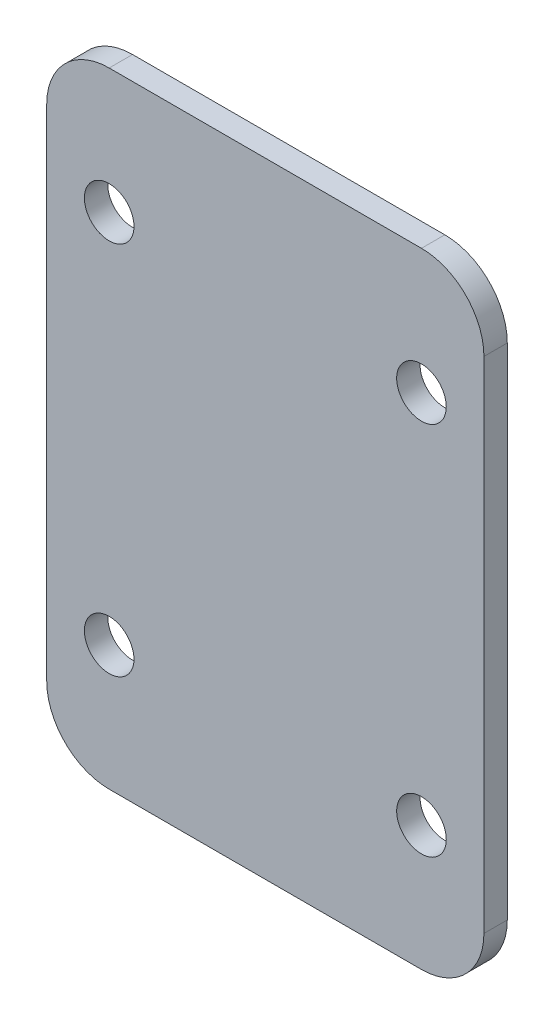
ISO-10303-21;
HEADER;
FILE_DESCRIPTION(('STEP AP214'),'2;1');
FILE_NAME('part.step','',(''),(''),'','','');
FILE_SCHEMA(('AUTOMOTIVE_DESIGN { 1 0 10303 214 1 1 1 1 }'));
ENDSEC;
DATA;
#1=APPLICATION_CONTEXT('core data for automotive mechanical design processes');
#2=APPLICATION_PROTOCOL_DEFINITION('international standard','automotive_design',2000,#1);
#3=PRODUCT_CONTEXT('',#1,'mechanical');
#4=PRODUCT('Part','Part','',(#3));
#5=PRODUCT_RELATED_PRODUCT_CATEGORY('part','',(#4));
#6=PRODUCT_DEFINITION_FORMATION('','',#4);
#7=PRODUCT_DEFINITION_CONTEXT('part definition',#1,'design');
#8=PRODUCT_DEFINITION('design','',#6,#7);
#9=PRODUCT_DEFINITION_SHAPE('','',#8);
#10=(LENGTH_UNIT() NAMED_UNIT(*) SI_UNIT(.MILLI.,.METRE.));
#11=(NAMED_UNIT(*) PLANE_ANGLE_UNIT() SI_UNIT($,.RADIAN.));
#12=(NAMED_UNIT(*) SI_UNIT($,.STERADIAN.) SOLID_ANGLE_UNIT());
#13=UNCERTAINTY_MEASURE_WITH_UNIT(LENGTH_MEASURE(1.E-05),#10,'distance_accuracy_value','');
#14=(GEOMETRIC_REPRESENTATION_CONTEXT(3) GLOBAL_UNCERTAINTY_ASSIGNED_CONTEXT((#13)) GLOBAL_UNIT_ASSIGNED_CONTEXT((#10,
#11,#12)) REPRESENTATION_CONTEXT('',''));
#15=CARTESIAN_POINT('',(0.,0.,0.));
#16=DIRECTION('',(0.,0.,1.));
#17=DIRECTION('',(1.,0.,0.));
#18=AXIS2_PLACEMENT_3D('',#15,#16,#17);
#19=CARTESIAN_POINT('',(0.,0.,4.74980000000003));
#20=DIRECTION('',(1.,0.,0.));
#21=DIRECTION('',(0.,0.,-1.));
#22=AXIS2_PLACEMENT_3D('',#19,#20,#21);
#23=PLANE('',#22);
#24=DIRECTION('',(0.,-1.,0.));
#25=VECTOR('',#24,1.);
#26=CARTESIAN_POINT('',(0.,0.,0.));
#27=LINE('',#26,#25);
#28=CARTESIAN_POINT('',(0.,114.3,-1.11022302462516E-13));
#29=VERTEX_POINT('',#28);
#30=CARTESIAN_POINT('',(0.,12.7,1.11022302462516E-13));
#31=VERTEX_POINT('',#30);
#32=EDGE_CURVE('E126',#29,#31,#27,.T.);
#33=ORIENTED_EDGE('',*,*,#32,.T.);
#34=DIRECTION('',(0.,0.,-1.));
#35=VECTOR('',#34,1.);
#36=CARTESIAN_POINT('',(0.,12.7,4.74980000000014));
#37=LINE('',#36,#35);
#38=CARTESIAN_POINT('',(0.,12.7,4.74980000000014));
#39=VERTEX_POINT('',#38);
#40=EDGE_CURVE('E155',#31,#39,#37,.F.);
#41=ORIENTED_EDGE('',*,*,#40,.T.);
#42=DIRECTION('',(0.,-1.,0.));
#43=VECTOR('',#42,1.);
#44=CARTESIAN_POINT('',(0.,0.,4.74980000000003));
#45=LINE('',#44,#43);
#46=CARTESIAN_POINT('',(0.,114.3,4.74979999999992));
#47=VERTEX_POINT('',#46);
#48=EDGE_CURVE('E124',#47,#39,#45,.T.);
#49=ORIENTED_EDGE('',*,*,#48,.F.);
#50=DIRECTION('',(0.,0.,-1.));
#51=VECTOR('',#50,1.);
#52=CARTESIAN_POINT('',(0.,114.3,4.74979999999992));
#53=LINE('',#52,#51);
#54=EDGE_CURVE('E152',#47,#29,#53,.T.);
#55=ORIENTED_EDGE('',*,*,#54,.T.);
#56=EDGE_LOOP('',(#33,#41,#49,#55));
#57=FACE_BOUND('',#56,.T.);
#58=ADVANCED_FACE('F30',(#57),#23,.F.);
#59=CARTESIAN_POINT('',(0.,0.,4.74980000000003));
#60=DIRECTION('',(0.,1.,0.));
#61=DIRECTION('',(0.,0.,1.));
#62=AXIS2_PLACEMENT_3D('',#59,#60,#61);
#63=PLANE('',#62);
#64=DIRECTION('',(1.,0.,0.));
#65=VECTOR('',#64,1.);
#66=CARTESIAN_POINT('',(0.,0.,0.));
#67=LINE('',#66,#65);
#68=CARTESIAN_POINT('',(12.7,1.11022302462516E-13,0.));
#69=VERTEX_POINT('',#68);
#70=CARTESIAN_POINT('',(76.2,0.,0.));
#71=VERTEX_POINT('',#70);
#72=EDGE_CURVE('E122',#69,#71,#67,.T.);
#73=ORIENTED_EDGE('',*,*,#72,.T.);
#74=DIRECTION('',(0.,0.,-1.));
#75=VECTOR('',#74,1.);
#76=CARTESIAN_POINT('',(76.2,0.,4.74979999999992));
#77=LINE('',#76,#75);
#78=CARTESIAN_POINT('',(76.2,0.,4.74979999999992));
#79=VERTEX_POINT('',#78);
#80=EDGE_CURVE('E100',#71,#79,#77,.F.);
#81=ORIENTED_EDGE('',*,*,#80,.T.);
#82=DIRECTION('',(1.,0.,0.));
#83=VECTOR('',#82,1.);
#84=CARTESIAN_POINT('',(0.,0.,4.74980000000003));
#85=LINE('',#84,#83);
#86=CARTESIAN_POINT('',(12.7,1.11022302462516E-13,4.74980000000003));
#87=VERTEX_POINT('',#86);
#88=EDGE_CURVE('E132',#87,#79,#85,.T.);
#89=ORIENTED_EDGE('',*,*,#88,.F.);
#90=DIRECTION('',(0.,0.,-1.));
#91=VECTOR('',#90,1.);
#92=CARTESIAN_POINT('',(12.7,1.11022302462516E-13,4.74980000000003));
#93=LINE('',#92,#91);
#94=EDGE_CURVE('E105',#87,#69,#93,.T.);
#95=ORIENTED_EDGE('',*,*,#94,.T.);
#96=EDGE_LOOP('',(#73,#81,#89,#95));
#97=FACE_BOUND('',#96,.T.);
#98=ADVANCED_FACE('F170',(#97),#63,.F.);
#99=CARTESIAN_POINT('',(88.8999999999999,0.,4.74979999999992));
#100=DIRECTION('',(-1.,0.,0.));
#101=DIRECTION('',(0.,0.,1.));
#102=AXIS2_PLACEMENT_3D('',#99,#100,#101);
#103=PLANE('',#102);
#104=DIRECTION('',(0.,1.,0.));
#105=VECTOR('',#104,1.);
#106=CARTESIAN_POINT('',(88.8999999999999,0.,4.74979999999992));
#107=LINE('',#106,#105);
#108=CARTESIAN_POINT('',(88.8999999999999,12.7,4.74980000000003));
#109=VERTEX_POINT('',#108);
#110=CARTESIAN_POINT('',(88.9,114.3,4.74980000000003));
#111=VERTEX_POINT('',#110);
#112=EDGE_CURVE('E114',#109,#111,#107,.T.);
#113=ORIENTED_EDGE('',*,*,#112,.F.);
#114=DIRECTION('',(0.,0.,-1.));
#115=VECTOR('',#114,1.);
#116=CARTESIAN_POINT('',(88.8999999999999,12.7,4.74980000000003));
#117=LINE('',#116,#115);
#118=CARTESIAN_POINT('',(88.9,12.7,0.));
#119=VERTEX_POINT('',#118);
#120=EDGE_CURVE('E99',#109,#119,#117,.T.);
#121=ORIENTED_EDGE('',*,*,#120,.T.);
#122=DIRECTION('',(0.,1.,0.));
#123=VECTOR('',#122,1.);
#124=CARTESIAN_POINT('',(88.9,0.,-1.11022302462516E-13));
#125=LINE('',#124,#123);
#126=CARTESIAN_POINT('',(88.9,114.3,0.));
#127=VERTEX_POINT('',#126);
#128=EDGE_CURVE('E112',#119,#127,#125,.T.);
#129=ORIENTED_EDGE('',*,*,#128,.T.);
#130=DIRECTION('',(0.,0.,-1.));
#131=VECTOR('',#130,1.);
#132=CARTESIAN_POINT('',(88.8999999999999,114.3,4.74980000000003));
#133=LINE('',#132,#131);
#134=EDGE_CURVE('E116',#127,#111,#133,.F.);
#135=ORIENTED_EDGE('',*,*,#134,.T.);
#136=EDGE_LOOP('',(#113,#121,#129,#135));
#137=FACE_BOUND('',#136,.T.);
#138=ADVANCED_FACE('F111',(#137),#103,.F.);
#139=CARTESIAN_POINT('',(0.,127.,4.74979999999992));
#140=DIRECTION('',(0.,-1.,0.));
#141=DIRECTION('',(0.,0.,-1.));
#142=AXIS2_PLACEMENT_3D('',#139,#140,#141);
#143=PLANE('',#142);
#144=DIRECTION('',(-1.,0.,0.));
#145=VECTOR('',#144,1.);
#146=CARTESIAN_POINT('',(0.,127.,4.74979999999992));
#147=LINE('',#146,#145);
#148=CARTESIAN_POINT('',(76.1999999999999,127.,4.74979999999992));
#149=VERTEX_POINT('',#148);
#150=CARTESIAN_POINT('',(12.7,127.,4.74979999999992));
#151=VERTEX_POINT('',#150);
#152=EDGE_CURVE('E136',#149,#151,#147,.T.);
#153=ORIENTED_EDGE('',*,*,#152,.F.);
#154=DIRECTION('',(0.,0.,-1.));
#155=VECTOR('',#154,1.);
#156=CARTESIAN_POINT('',(76.1999999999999,127.,4.74979999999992));
#157=LINE('',#156,#155);
#158=CARTESIAN_POINT('',(76.2,127.,0.));
#159=VERTEX_POINT('',#158);
#160=EDGE_CURVE('E11',#149,#159,#157,.T.);
#161=ORIENTED_EDGE('',*,*,#160,.T.);
#162=DIRECTION('',(-1.,0.,0.));
#163=VECTOR('',#162,1.);
#164=CARTESIAN_POINT('',(0.,127.,-1.11022302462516E-13));
#165=LINE('',#164,#163);
#166=CARTESIAN_POINT('',(12.7,127.,-1.11022302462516E-13));
#167=VERTEX_POINT('',#166);
#168=EDGE_CURVE('E121',#159,#167,#165,.T.);
#169=ORIENTED_EDGE('',*,*,#168,.T.);
#170=DIRECTION('',(0.,0.,-1.));
#171=VECTOR('',#170,1.);
#172=CARTESIAN_POINT('',(12.7,127.,4.74979999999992));
#173=LINE('',#172,#171);
#174=EDGE_CURVE('E37',#167,#151,#173,.F.);
#175=ORIENTED_EDGE('',*,*,#174,.T.);
#176=EDGE_LOOP('',(#153,#161,#169,#175));
#177=FACE_BOUND('',#176,.T.);
#178=ADVANCED_FACE('F201',(#177),#143,.F.);
#179=CARTESIAN_POINT('',(0.,127.,4.74979999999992));
#180=DIRECTION('',(0.,0.,-1.));
#181=DIRECTION('',(-1.,0.,0.));
#182=AXIS2_PLACEMENT_3D('',#179,#180,#181);
#183=PLANE('',#182);
#184=CARTESIAN_POINT('',(76.2,101.6,4.74980000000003));
#185=DIRECTION('',(0.,0.,1.));
#186=DIRECTION('',(-1.,0.,0.));
#187=AXIS2_PLACEMENT_3D('',#184,#185,#186);
#188=CIRCLE('',#187,5.0419);
#189=CARTESIAN_POINT('',(81.2419,101.6,4.74980000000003));
#190=VERTEX_POINT('',#189);
#191=EDGE_CURVE('E193',#190,#190,#188,.T.);
#192=ORIENTED_EDGE('',*,*,#191,.F.);
#193=EDGE_LOOP('',(#192));
#194=FACE_BOUND('',#193,.T.);
#195=CARTESIAN_POINT('',(76.2,25.4,4.74980000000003));
#196=DIRECTION('',(0.,0.,1.));
#197=DIRECTION('',(-1.,0.,0.));
#198=AXIS2_PLACEMENT_3D('',#195,#196,#197);
#199=CIRCLE('',#198,5.0419);
#200=CARTESIAN_POINT('',(81.2419,25.4,4.74980000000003));
#201=VERTEX_POINT('',#200);
#202=EDGE_CURVE('E187',#201,#201,#199,.T.);
#203=ORIENTED_EDGE('',*,*,#202,.F.);
#204=EDGE_LOOP('',(#203));
#205=FACE_BOUND('',#204,.T.);
#206=CARTESIAN_POINT('',(12.7,25.4,4.74980000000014));
#207=DIRECTION('',(0.,0.,1.));
#208=DIRECTION('',(1.,0.,0.));
#209=AXIS2_PLACEMENT_3D('',#206,#207,#208);
#210=CIRCLE('',#209,5.0419);
#211=CARTESIAN_POINT('',(17.7419,25.4,4.74980000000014));
#212=VERTEX_POINT('',#211);
#213=EDGE_CURVE('E181',#212,#212,#210,.T.);
#214=ORIENTED_EDGE('',*,*,#213,.F.);
#215=EDGE_LOOP('',(#214));
#216=FACE_BOUND('',#215,.T.);
#217=CARTESIAN_POINT('',(12.7,101.6,4.74979999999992));
#218=DIRECTION('',(0.,0.,1.));
#219=DIRECTION('',(1.,0.,0.));
#220=AXIS2_PLACEMENT_3D('',#217,#218,#219);
#221=CIRCLE('',#220,5.04190000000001);
#222=CARTESIAN_POINT('',(17.7419,101.6,4.74979999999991));
#223=VERTEX_POINT('',#222);
#224=EDGE_CURVE('E173',#223,#223,#221,.T.);
#225=ORIENTED_EDGE('',*,*,#224,.F.);
#226=EDGE_LOOP('',(#225));
#227=FACE_BOUND('',#226,.T.);
#228=ORIENTED_EDGE('',*,*,#88,.T.);
#229=CARTESIAN_POINT('',(76.2,12.7,4.74980000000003));
#230=DIRECTION('',(0.,0.,-1.));
#231=DIRECTION('',(0.,1.,0.));
#232=AXIS2_PLACEMENT_3D('',#229,#230,#231);
#233=CIRCLE('',#232,12.7);
#234=EDGE_CURVE('E150',#79,#109,#233,.F.);
#235=ORIENTED_EDGE('',*,*,#234,.T.);
#236=ORIENTED_EDGE('',*,*,#112,.T.);
#237=CARTESIAN_POINT('',(76.1999999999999,114.3,4.74979999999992));
#238=DIRECTION('',(0.,0.,-1.));
#239=DIRECTION('',(0.,1.,0.));
#240=AXIS2_PLACEMENT_3D('',#237,#238,#239);
#241=CIRCLE('',#240,12.7);
#242=EDGE_CURVE('E50',#111,#149,#241,.F.);
#243=ORIENTED_EDGE('',*,*,#242,.T.);
#244=ORIENTED_EDGE('',*,*,#152,.T.);
#245=CARTESIAN_POINT('',(12.7,114.3,4.74980000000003));
#246=DIRECTION('',(0.,0.,-1.));
#247=DIRECTION('',(0.,1.,0.));
#248=AXIS2_PLACEMENT_3D('',#245,#246,#247);
#249=CIRCLE('',#248,12.7);
#250=EDGE_CURVE('E145',#151,#47,#249,.F.);
#251=ORIENTED_EDGE('',*,*,#250,.T.);
#252=ORIENTED_EDGE('',*,*,#48,.T.);
#253=CARTESIAN_POINT('',(12.7,12.7,4.74980000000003));
#254=DIRECTION('',(0.,0.,-1.));
#255=DIRECTION('',(0.,1.,0.));
#256=AXIS2_PLACEMENT_3D('',#253,#254,#255);
#257=CIRCLE('',#256,12.7);
#258=EDGE_CURVE('E148',#39,#87,#257,.F.);
#259=ORIENTED_EDGE('',*,*,#258,.T.);
#260=EDGE_LOOP('',(#228,#235,#236,#243,#244,#251,#252,#259));
#261=FACE_BOUND('',#260,.T.);
#262=ADVANCED_FACE('F164',(#194,#205,#216,#227,#261),#183,.F.);
#263=CARTESIAN_POINT('',(0.,127.,-1.11022302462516E-13));
#264=DIRECTION('',(0.,0.,-1.));
#265=DIRECTION('',(-1.,0.,0.));
#266=AXIS2_PLACEMENT_3D('',#263,#264,#265);
#267=PLANE('',#266);
#268=CARTESIAN_POINT('',(76.2,101.6,0.));
#269=DIRECTION('',(0.,0.,1.));
#270=DIRECTION('',(-1.,0.,0.));
#271=AXIS2_PLACEMENT_3D('',#268,#269,#270);
#272=CIRCLE('',#271,5.0419);
#273=CARTESIAN_POINT('',(81.2419,101.6,0.));
#274=VERTEX_POINT('',#273);
#275=EDGE_CURVE('E190',#274,#274,#272,.T.);
#276=ORIENTED_EDGE('',*,*,#275,.T.);
#277=EDGE_LOOP('',(#276));
#278=FACE_BOUND('',#277,.T.);
#279=CARTESIAN_POINT('',(76.2,25.4,0.));
#280=DIRECTION('',(0.,0.,1.));
#281=DIRECTION('',(-1.,0.,0.));
#282=AXIS2_PLACEMENT_3D('',#279,#280,#281);
#283=CIRCLE('',#282,5.0419);
#284=CARTESIAN_POINT('',(81.2419,25.4,0.));
#285=VERTEX_POINT('',#284);
#286=EDGE_CURVE('E184',#285,#285,#283,.T.);
#287=ORIENTED_EDGE('',*,*,#286,.T.);
#288=EDGE_LOOP('',(#287));
#289=FACE_BOUND('',#288,.T.);
#290=CARTESIAN_POINT('',(12.7,25.4,1.11022302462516E-13));
#291=DIRECTION('',(0.,0.,1.));
#292=DIRECTION('',(1.,0.,0.));
#293=AXIS2_PLACEMENT_3D('',#290,#291,#292);
#294=CIRCLE('',#293,5.0419);
#295=CARTESIAN_POINT('',(17.7419,25.4,1.11022302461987E-13));
#296=VERTEX_POINT('',#295);
#297=EDGE_CURVE('E178',#296,#296,#294,.T.);
#298=ORIENTED_EDGE('',*,*,#297,.T.);
#299=EDGE_LOOP('',(#298));
#300=FACE_BOUND('',#299,.T.);
#301=CARTESIAN_POINT('',(12.7,101.6,-1.11022302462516E-13));
#302=DIRECTION('',(0.,0.,1.));
#303=DIRECTION('',(1.,0.,0.));
#304=AXIS2_PLACEMENT_3D('',#301,#302,#303);
#305=CIRCLE('',#304,5.04190000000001);
#306=CARTESIAN_POINT('',(17.7419,101.6,-1.11022302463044E-13));
#307=VERTEX_POINT('',#306);
#308=EDGE_CURVE('E171',#307,#307,#305,.T.);
#309=ORIENTED_EDGE('',*,*,#308,.T.);
#310=EDGE_LOOP('',(#309));
#311=FACE_BOUND('',#310,.T.);
#312=ORIENTED_EDGE('',*,*,#128,.F.);
#313=CARTESIAN_POINT('',(76.2,12.7,0.));
#314=DIRECTION('',(0.,0.,-1.));
#315=DIRECTION('',(0.,1.,0.));
#316=AXIS2_PLACEMENT_3D('',#313,#314,#315);
#317=CIRCLE('',#316,12.7);
#318=EDGE_CURVE('E95',#119,#71,#317,.T.);
#319=ORIENTED_EDGE('',*,*,#318,.T.);
#320=ORIENTED_EDGE('',*,*,#72,.F.);
#321=CARTESIAN_POINT('',(12.7,12.7,1.11022302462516E-13));
#322=DIRECTION('',(0.,0.,-1.));
#323=DIRECTION('',(0.,1.,0.));
#324=AXIS2_PLACEMENT_3D('',#321,#322,#323);
#325=CIRCLE('',#324,12.7);
#326=EDGE_CURVE('E106',#69,#31,#325,.T.);
#327=ORIENTED_EDGE('',*,*,#326,.T.);
#328=ORIENTED_EDGE('',*,*,#32,.F.);
#329=CARTESIAN_POINT('',(12.7,114.3,0.));
#330=DIRECTION('',(0.,0.,-1.));
#331=DIRECTION('',(0.,1.,0.));
#332=AXIS2_PLACEMENT_3D('',#329,#330,#331);
#333=CIRCLE('',#332,12.7);
#334=EDGE_CURVE('E115',#29,#167,#333,.T.);
#335=ORIENTED_EDGE('',*,*,#334,.T.);
#336=ORIENTED_EDGE('',*,*,#168,.F.);
#337=CARTESIAN_POINT('',(76.2,114.3,0.));
#338=DIRECTION('',(0.,0.,-1.));
#339=DIRECTION('',(0.,1.,0.));
#340=AXIS2_PLACEMENT_3D('',#337,#338,#339);
#341=CIRCLE('',#340,12.7);
#342=EDGE_CURVE('E120',#159,#127,#341,.T.);
#343=ORIENTED_EDGE('',*,*,#342,.T.);
#344=EDGE_LOOP('',(#312,#319,#320,#327,#328,#335,#336,#343));
#345=FACE_BOUND('',#344,.T.);
#346=ADVANCED_FACE('F118',(#278,#289,#300,#311,#345),#267,.T.);
#347=CARTESIAN_POINT('',(12.7,101.6,-1.11022302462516E-13));
#348=DIRECTION('',(0.,0.,1.));
#349=DIRECTION('',(1.,0.,0.));
#350=AXIS2_PLACEMENT_3D('',#347,#348,#349);
#351=CYLINDRICAL_SURFACE('',#350,5.04190000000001);
#352=CARTESIAN_POINT('',(17.7419,101.6,-1.11022302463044E-13));
#353=CARTESIAN_POINT('',(17.7419,101.6,0.0494770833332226));
#354=CARTESIAN_POINT('',(17.7419,101.6,0.0989541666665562));
#355=CARTESIAN_POINT('',(17.7419,101.6,0.197908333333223));
#356=CARTESIAN_POINT('',(17.7419,101.6,0.247385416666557));
#357=CARTESIAN_POINT('',(17.7419,101.6,0.346339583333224));
#358=CARTESIAN_POINT('',(17.7419,101.6,0.395816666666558));
#359=CARTESIAN_POINT('',(17.7419,101.6,0.494770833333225));
#360=CARTESIAN_POINT('',(17.7419,101.6,0.544247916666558));
#361=CARTESIAN_POINT('',(17.7419,101.6,0.643202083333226));
#362=CARTESIAN_POINT('',(17.7419,101.6,0.692679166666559));
#363=CARTESIAN_POINT('',(17.7419,101.6,0.791633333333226));
#364=CARTESIAN_POINT('',(17.7419,101.6,0.84111041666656));
#365=CARTESIAN_POINT('',(17.7419,101.6,0.940064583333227));
#366=CARTESIAN_POINT('',(17.7419,101.6,0.989541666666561));
#367=CARTESIAN_POINT('',(17.7419,101.6,1.08849583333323));
#368=CARTESIAN_POINT('',(17.7419,101.6,1.13797291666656));
#369=CARTESIAN_POINT('',(17.7419,101.6,1.23692708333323));
#370=CARTESIAN_POINT('',(17.7419,101.6,1.28640416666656));
#371=CARTESIAN_POINT('',(17.7419,101.6,1.38535833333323));
#372=CARTESIAN_POINT('',(17.7419,101.6,1.43483541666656));
#373=CARTESIAN_POINT('',(17.7419,101.6,1.53378958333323));
#374=CARTESIAN_POINT('',(17.7419,101.6,1.58326666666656));
#375=CARTESIAN_POINT('',(17.7419,101.6,1.68222083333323));
#376=CARTESIAN_POINT('',(17.7419,101.6,1.73169791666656));
#377=CARTESIAN_POINT('',(17.7419,101.6,1.83065208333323));
#378=CARTESIAN_POINT('',(17.7419,101.6,1.88012916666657));
#379=CARTESIAN_POINT('',(17.7419,101.6,1.97908333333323));
#380=CARTESIAN_POINT('',(17.7419,101.6,2.02856041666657));
#381=CARTESIAN_POINT('',(17.7419,101.6,2.12751458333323));
#382=CARTESIAN_POINT('',(17.7419,101.6,2.17699166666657));
#383=CARTESIAN_POINT('',(17.7419,101.6,2.27594583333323));
#384=CARTESIAN_POINT('',(17.7419,101.6,2.32542291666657));
#385=CARTESIAN_POINT('',(17.7419,101.6,2.42437708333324));
#386=CARTESIAN_POINT('',(17.7419,101.6,2.47385416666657));
#387=CARTESIAN_POINT('',(17.7419,101.6,2.57280833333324));
#388=CARTESIAN_POINT('',(17.7419,101.6,2.62228541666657));
#389=CARTESIAN_POINT('',(17.7419,101.6,2.72123958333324));
#390=CARTESIAN_POINT('',(17.7419,101.6,2.77071666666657));
#391=CARTESIAN_POINT('',(17.7419,101.6,2.86967083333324));
#392=CARTESIAN_POINT('',(17.7419,101.6,2.91914791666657));
#393=CARTESIAN_POINT('',(17.7419,101.6,3.01810208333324));
#394=CARTESIAN_POINT('',(17.7419,101.6,3.06757916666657));
#395=CARTESIAN_POINT('',(17.7419,101.6,3.16653333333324));
#396=CARTESIAN_POINT('',(17.7419,101.6,3.21601041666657));
#397=CARTESIAN_POINT('',(17.7419,101.6,3.31496458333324));
#398=CARTESIAN_POINT('',(17.7419,101.6,3.36444166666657));
#399=CARTESIAN_POINT('',(17.7419,101.6,3.46339583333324));
#400=CARTESIAN_POINT('',(17.7419,101.6,3.51287291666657));
#401=CARTESIAN_POINT('',(17.7419,101.6,3.61182708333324));
#402=CARTESIAN_POINT('',(17.7419,101.6,3.66130416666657));
#403=CARTESIAN_POINT('',(17.7419,101.6,3.76025833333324));
#404=CARTESIAN_POINT('',(17.7419,101.6,3.80973541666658));
#405=CARTESIAN_POINT('',(17.7419,101.6,3.90868958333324));
#406=CARTESIAN_POINT('',(17.7419,101.6,3.95816666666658));
#407=CARTESIAN_POINT('',(17.7419,101.6,4.05712083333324));
#408=CARTESIAN_POINT('',(17.7419,101.6,4.10659791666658));
#409=CARTESIAN_POINT('',(17.7419,101.6,4.20555208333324));
#410=CARTESIAN_POINT('',(17.7419,101.6,4.25502916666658));
#411=CARTESIAN_POINT('',(17.7419,101.6,4.35398333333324));
#412=CARTESIAN_POINT('',(17.7419,101.6,4.40346041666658));
#413=CARTESIAN_POINT('',(17.7419,101.6,4.50241458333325));
#414=CARTESIAN_POINT('',(17.7419,101.6,4.55189166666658));
#415=CARTESIAN_POINT('',(17.7419,101.6,4.65084583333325));
#416=CARTESIAN_POINT('',(17.7419,101.6,4.70032291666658));
#417=CARTESIAN_POINT('',(17.7419,101.6,4.74979999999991));
#418=B_SPLINE_CURVE_WITH_KNOTS('',3,(#352,#353,#354,#355,#356,#357,#358,#359,#360,#361,#362,
#363,#364,#365,#366,#367,#368,#369,#370,#371,#372,#373,#374,#375,#376,#377,#378,#379,#380,#381,
#382,#383,#384,#385,#386,#387,#388,#389,#390,#391,#392,#393,#394,#395,#396,#397,#398,#399,#400,
#401,#402,#403,#404,#405,#406,#407,#408,#409,#410,#411,#412,#413,#414,#415,#416,#417),
.UNSPECIFIED.,.F.,.F.,(4,2,2,2,2,2,2,2,2,2,2,2,2,2,2,2,2,2,2,2,2,2,2,2,2,2,2,2,2,2,2,2,4),(0.,
0.148431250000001,0.296862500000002,0.445293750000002,0.593725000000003,0.742156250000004,
0.890587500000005,1.03901875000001,1.18745000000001,1.33588125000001,1.48431250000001,
1.63274375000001,1.78117500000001,1.92960625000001,2.07803750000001,2.22646875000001,
2.37490000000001,2.52333125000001,2.67176250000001,2.82019375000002,2.96862500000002,
3.11705625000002,3.26548750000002,3.41391875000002,3.56235000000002,3.71078125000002,
3.85921250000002,4.00764375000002,4.15607500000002,4.30450625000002,4.45293750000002,
4.60136875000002,4.74980000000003),.UNSPECIFIED.);
#419=EDGE_CURVE('BSEAM209',#307,#223,#418,.T.);
#420=ORIENTED_EDGE('',*,*,#308,.F.);
#421=ORIENTED_EDGE('',*,*,#224,.T.);
#422=ORIENTED_EDGE('',*,*,#419,.T.);
#423=ORIENTED_EDGE('',*,*,#419,.F.);
#424=EDGE_LOOP('',(#420,#422,#421,#423));
#425=FACE_BOUND('',#424,.T.);
#426=ADVANCED_FACE('F209',(#425),#351,.F.);
#427=CARTESIAN_POINT('',(12.7,25.4,1.11022302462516E-13));
#428=DIRECTION('',(0.,0.,1.));
#429=DIRECTION('',(1.,0.,0.));
#430=AXIS2_PLACEMENT_3D('',#427,#428,#429);
#431=CYLINDRICAL_SURFACE('',#430,5.0419);
#432=CARTESIAN_POINT('',(17.7419,25.4,1.11022302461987E-13));
#433=CARTESIAN_POINT('',(17.7419,25.4,0.0494770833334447));
#434=CARTESIAN_POINT('',(17.7419,25.4,0.0989541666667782));
#435=CARTESIAN_POINT('',(17.7419,25.4,0.197908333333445));
#436=CARTESIAN_POINT('',(17.7419,25.4,0.247385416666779));
#437=CARTESIAN_POINT('',(17.7419,25.4,0.346339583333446));
#438=CARTESIAN_POINT('',(17.7419,25.4,0.39581666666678));
#439=CARTESIAN_POINT('',(17.7419,25.4,0.494770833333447));
#440=CARTESIAN_POINT('',(17.7419,25.4,0.544247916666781));
#441=CARTESIAN_POINT('',(17.7419,25.4,0.643202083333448));
#442=CARTESIAN_POINT('',(17.7419,25.4,0.692679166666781));
#443=CARTESIAN_POINT('',(17.7419,25.4,0.791633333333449));
#444=CARTESIAN_POINT('',(17.7419,25.4,0.841110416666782));
#445=CARTESIAN_POINT('',(17.7419,25.4,0.940064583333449));
#446=CARTESIAN_POINT('',(17.7419,25.4,0.989541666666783));
#447=CARTESIAN_POINT('',(17.7419,25.4,1.08849583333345));
#448=CARTESIAN_POINT('',(17.7419,25.4,1.13797291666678));
#449=CARTESIAN_POINT('',(17.7419,25.4,1.23692708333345));
#450=CARTESIAN_POINT('',(17.7419,25.4,1.28640416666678));
#451=CARTESIAN_POINT('',(17.7419,25.4,1.38535833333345));
#452=CARTESIAN_POINT('',(17.7419,25.4,1.43483541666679));
#453=CARTESIAN_POINT('',(17.7419,25.4,1.53378958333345));
#454=CARTESIAN_POINT('',(17.7419,25.4,1.58326666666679));
#455=CARTESIAN_POINT('',(17.7419,25.4,1.68222083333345));
#456=CARTESIAN_POINT('',(17.7419,25.4,1.73169791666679));
#457=CARTESIAN_POINT('',(17.7419,25.4,1.83065208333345));
#458=CARTESIAN_POINT('',(17.7419,25.4,1.88012916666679));
#459=CARTESIAN_POINT('',(17.7419,25.4,1.97908333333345));
#460=CARTESIAN_POINT('',(17.7419,25.4,2.02856041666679));
#461=CARTESIAN_POINT('',(17.7419,25.4,2.12751458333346));
#462=CARTESIAN_POINT('',(17.7419,25.4,2.17699166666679));
#463=CARTESIAN_POINT('',(17.7419,25.4,2.27594583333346));
#464=CARTESIAN_POINT('',(17.7419,25.4,2.32542291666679));
#465=CARTESIAN_POINT('',(17.7419,25.4,2.42437708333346));
#466=CARTESIAN_POINT('',(17.7419,25.4,2.47385416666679));
#467=CARTESIAN_POINT('',(17.7419,25.4,2.57280833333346));
#468=CARTESIAN_POINT('',(17.7419,25.4,2.62228541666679));
#469=CARTESIAN_POINT('',(17.7419,25.4,2.72123958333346));
#470=CARTESIAN_POINT('',(17.7419,25.4,2.77071666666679));
#471=CARTESIAN_POINT('',(17.7419,25.4,2.86967083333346));
#472=CARTESIAN_POINT('',(17.7419,25.4,2.91914791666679));
#473=CARTESIAN_POINT('',(17.7419,25.4,3.01810208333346));
#474=CARTESIAN_POINT('',(17.7419,25.4,3.06757916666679));
#475=CARTESIAN_POINT('',(17.7419,25.4,3.16653333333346));
#476=CARTESIAN_POINT('',(17.7419,25.4,3.21601041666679));
#477=CARTESIAN_POINT('',(17.7419,25.4,3.31496458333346));
#478=CARTESIAN_POINT('',(17.7419,25.4,3.3644416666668));
#479=CARTESIAN_POINT('',(17.7419,25.4,3.46339583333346));
#480=CARTESIAN_POINT('',(17.7419,25.4,3.5128729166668));
#481=CARTESIAN_POINT('',(17.7419,25.4,3.61182708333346));
#482=CARTESIAN_POINT('',(17.7419,25.4,3.6613041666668));
#483=CARTESIAN_POINT('',(17.7419,25.4,3.76025833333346));
#484=CARTESIAN_POINT('',(17.7419,25.4,3.8097354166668));
#485=CARTESIAN_POINT('',(17.7419,25.4,3.90868958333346));
#486=CARTESIAN_POINT('',(17.7419,25.4,3.9581666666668));
#487=CARTESIAN_POINT('',(17.7419,25.4,4.05712083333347));
#488=CARTESIAN_POINT('',(17.7419,25.4,4.1065979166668));
#489=CARTESIAN_POINT('',(17.7419,25.4,4.20555208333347));
#490=CARTESIAN_POINT('',(17.7419,25.4,4.2550291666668));
#491=CARTESIAN_POINT('',(17.7419,25.4,4.35398333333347));
#492=CARTESIAN_POINT('',(17.7419,25.4,4.4034604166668));
#493=CARTESIAN_POINT('',(17.7419,25.4,4.50241458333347));
#494=CARTESIAN_POINT('',(17.7419,25.4,4.5518916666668));
#495=CARTESIAN_POINT('',(17.7419,25.4,4.65084583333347));
#496=CARTESIAN_POINT('',(17.7419,25.4,4.7003229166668));
#497=CARTESIAN_POINT('',(17.7419,25.4,4.74980000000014));
#498=B_SPLINE_CURVE_WITH_KNOTS('',3,(#432,#433,#434,#435,#436,#437,#438,#439,#440,#441,#442,
#443,#444,#445,#446,#447,#448,#449,#450,#451,#452,#453,#454,#455,#456,#457,#458,#459,#460,#461,
#462,#463,#464,#465,#466,#467,#468,#469,#470,#471,#472,#473,#474,#475,#476,#477,#478,#479,#480,
#481,#482,#483,#484,#485,#486,#487,#488,#489,#490,#491,#492,#493,#494,#495,#496,#497),
.UNSPECIFIED.,.F.,.F.,(4,2,2,2,2,2,2,2,2,2,2,2,2,2,2,2,2,2,2,2,2,2,2,2,2,2,2,2,2,2,2,2,4),(0.,
0.148431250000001,0.296862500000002,0.445293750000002,0.593725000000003,0.742156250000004,
0.890587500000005,1.03901875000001,1.18745000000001,1.33588125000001,1.48431250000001,
1.63274375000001,1.78117500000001,1.92960625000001,2.07803750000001,2.22646875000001,
2.37490000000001,2.52333125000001,2.67176250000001,2.82019375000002,2.96862500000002,
3.11705625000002,3.26548750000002,3.41391875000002,3.56235000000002,3.71078125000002,
3.85921250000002,4.00764375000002,4.15607500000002,4.30450625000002,4.45293750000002,
4.60136875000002,4.74980000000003),.UNSPECIFIED.);
#499=EDGE_CURVE('BSEAM211',#296,#212,#498,.T.);
#500=ORIENTED_EDGE('',*,*,#297,.F.);
#501=ORIENTED_EDGE('',*,*,#213,.T.);
#502=ORIENTED_EDGE('',*,*,#499,.T.);
#503=ORIENTED_EDGE('',*,*,#499,.F.);
#504=EDGE_LOOP('',(#500,#502,#501,#503));
#505=FACE_BOUND('',#504,.T.);
#506=ADVANCED_FACE('F211',(#505),#431,.F.);
#507=CARTESIAN_POINT('',(76.2,25.4,0.));
#508=DIRECTION('',(0.,0.,1.));
#509=DIRECTION('',(1.,0.,0.));
#510=AXIS2_PLACEMENT_3D('',#507,#508,#509);
#511=CYLINDRICAL_SURFACE('',#510,5.0419);
#512=CARTESIAN_POINT('',(81.2419,25.4,0.));
#513=CARTESIAN_POINT('',(81.2419,25.4,0.0494770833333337));
#514=CARTESIAN_POINT('',(81.2419,25.4,0.0989541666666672));
#515=CARTESIAN_POINT('',(81.2419,25.4,0.197908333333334));
#516=CARTESIAN_POINT('',(81.2419,25.4,0.247385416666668));
#517=CARTESIAN_POINT('',(81.2419,25.4,0.346339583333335));
#518=CARTESIAN_POINT('',(81.2419,25.4,0.395816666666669));
#519=CARTESIAN_POINT('',(81.2419,25.4,0.494770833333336));
#520=CARTESIAN_POINT('',(81.2419,25.4,0.544247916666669));
#521=CARTESIAN_POINT('',(81.2419,25.4,0.643202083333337));
#522=CARTESIAN_POINT('',(81.2419,25.4,0.69267916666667));
#523=CARTESIAN_POINT('',(81.2419,25.4,0.791633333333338));
#524=CARTESIAN_POINT('',(81.2419,25.4,0.841110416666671));
#525=CARTESIAN_POINT('',(81.2419,25.4,0.940064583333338));
#526=CARTESIAN_POINT('',(81.2419,25.4,0.989541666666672));
#527=CARTESIAN_POINT('',(81.2419,25.4,1.08849583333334));
#528=CARTESIAN_POINT('',(81.2419,25.4,1.13797291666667));
#529=CARTESIAN_POINT('',(81.2419,25.4,1.23692708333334));
#530=CARTESIAN_POINT('',(81.2419,25.4,1.28640416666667));
#531=CARTESIAN_POINT('',(81.2419,25.4,1.38535833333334));
#532=CARTESIAN_POINT('',(81.2419,25.4,1.43483541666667));
#533=CARTESIAN_POINT('',(81.2419,25.4,1.53378958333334));
#534=CARTESIAN_POINT('',(81.2419,25.4,1.58326666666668));
#535=CARTESIAN_POINT('',(81.2419,25.4,1.68222083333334));
#536=CARTESIAN_POINT('',(81.2419,25.4,1.73169791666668));
#537=CARTESIAN_POINT('',(81.2419,25.4,1.83065208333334));
#538=CARTESIAN_POINT('',(81.2419,25.4,1.88012916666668));
#539=CARTESIAN_POINT('',(81.2419,25.4,1.97908333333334));
#540=CARTESIAN_POINT('',(81.2419,25.4,2.02856041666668));
#541=CARTESIAN_POINT('',(81.2419,25.4,2.12751458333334));
#542=CARTESIAN_POINT('',(81.2419,25.4,2.17699166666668));
#543=CARTESIAN_POINT('',(81.2419,25.4,2.27594583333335));
#544=CARTESIAN_POINT('',(81.2419,25.4,2.32542291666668));
#545=CARTESIAN_POINT('',(81.2419,25.4,2.42437708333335));
#546=CARTESIAN_POINT('',(81.2419,25.4,2.47385416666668));
#547=CARTESIAN_POINT('',(81.2419,25.4,2.57280833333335));
#548=CARTESIAN_POINT('',(81.2419,25.4,2.62228541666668));
#549=CARTESIAN_POINT('',(81.2419,25.4,2.72123958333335));
#550=CARTESIAN_POINT('',(81.2419,25.4,2.77071666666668));
#551=CARTESIAN_POINT('',(81.2419,25.4,2.86967083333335));
#552=CARTESIAN_POINT('',(81.2419,25.4,2.91914791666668));
#553=CARTESIAN_POINT('',(81.2419,25.4,3.01810208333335));
#554=CARTESIAN_POINT('',(81.2419,25.4,3.06757916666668));
#555=CARTESIAN_POINT('',(81.2419,25.4,3.16653333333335));
#556=CARTESIAN_POINT('',(81.2419,25.4,3.21601041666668));
#557=CARTESIAN_POINT('',(81.2419,25.4,3.31496458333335));
#558=CARTESIAN_POINT('',(81.2419,25.4,3.36444166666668));
#559=CARTESIAN_POINT('',(81.2419,25.4,3.46339583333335));
#560=CARTESIAN_POINT('',(81.2419,25.4,3.51287291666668));
#561=CARTESIAN_POINT('',(81.2419,25.4,3.61182708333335));
#562=CARTESIAN_POINT('',(81.2419,25.4,3.66130416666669));
#563=CARTESIAN_POINT('',(81.2419,25.4,3.76025833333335));
#564=CARTESIAN_POINT('',(81.2419,25.4,3.80973541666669));
#565=CARTESIAN_POINT('',(81.2419,25.4,3.90868958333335));
#566=CARTESIAN_POINT('',(81.2419,25.4,3.95816666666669));
#567=CARTESIAN_POINT('',(81.2419,25.4,4.05712083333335));
#568=CARTESIAN_POINT('',(81.2419,25.4,4.10659791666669));
#569=CARTESIAN_POINT('',(81.2419,25.4,4.20555208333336));
#570=CARTESIAN_POINT('',(81.2419,25.4,4.25502916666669));
#571=CARTESIAN_POINT('',(81.2419,25.4,4.35398333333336));
#572=CARTESIAN_POINT('',(81.2419,25.4,4.40346041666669));
#573=CARTESIAN_POINT('',(81.2419,25.4,4.50241458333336));
#574=CARTESIAN_POINT('',(81.2419,25.4,4.55189166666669));
#575=CARTESIAN_POINT('',(81.2419,25.4,4.65084583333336));
#576=CARTESIAN_POINT('',(81.2419,25.4,4.70032291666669));
#577=CARTESIAN_POINT('',(81.2419,25.4,4.74980000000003));
#578=B_SPLINE_CURVE_WITH_KNOTS('',3,(#512,#513,#514,#515,#516,#517,#518,#519,#520,#521,#522,
#523,#524,#525,#526,#527,#528,#529,#530,#531,#532,#533,#534,#535,#536,#537,#538,#539,#540,#541,
#542,#543,#544,#545,#546,#547,#548,#549,#550,#551,#552,#553,#554,#555,#556,#557,#558,#559,#560,
#561,#562,#563,#564,#565,#566,#567,#568,#569,#570,#571,#572,#573,#574,#575,#576,#577),
.UNSPECIFIED.,.F.,.F.,(4,2,2,2,2,2,2,2,2,2,2,2,2,2,2,2,2,2,2,2,2,2,2,2,2,2,2,2,2,2,2,2,4),(0.,
0.148431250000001,0.296862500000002,0.445293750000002,0.593725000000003,0.742156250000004,
0.890587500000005,1.03901875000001,1.18745000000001,1.33588125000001,1.48431250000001,
1.63274375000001,1.78117500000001,1.92960625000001,2.07803750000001,2.22646875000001,
2.37490000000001,2.52333125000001,2.67176250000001,2.82019375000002,2.96862500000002,
3.11705625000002,3.26548750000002,3.41391875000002,3.56235000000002,3.71078125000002,
3.85921250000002,4.00764375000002,4.15607500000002,4.30450625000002,4.45293750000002,
4.60136875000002,4.74980000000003),.UNSPECIFIED.);
#579=EDGE_CURVE('BSEAM218',#285,#201,#578,.T.);
#580=ORIENTED_EDGE('',*,*,#286,.F.);
#581=ORIENTED_EDGE('',*,*,#202,.T.);
#582=ORIENTED_EDGE('',*,*,#579,.T.);
#583=ORIENTED_EDGE('',*,*,#579,.F.);
#584=EDGE_LOOP('',(#580,#582,#581,#583));
#585=FACE_BOUND('',#584,.T.);
#586=ADVANCED_FACE('F218',(#585),#511,.F.);
#587=CARTESIAN_POINT('',(76.2,101.6,0.));
#588=DIRECTION('',(0.,0.,1.));
#589=DIRECTION('',(1.,0.,0.));
#590=AXIS2_PLACEMENT_3D('',#587,#588,#589);
#591=CYLINDRICAL_SURFACE('',#590,5.0419);
#592=CARTESIAN_POINT('',(81.2419,101.6,0.));
#593=CARTESIAN_POINT('',(81.2419,101.6,0.0494770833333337));
#594=CARTESIAN_POINT('',(81.2419,101.6,0.0989541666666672));
#595=CARTESIAN_POINT('',(81.2419,101.6,0.197908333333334));
#596=CARTESIAN_POINT('',(81.2419,101.6,0.247385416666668));
#597=CARTESIAN_POINT('',(81.2419,101.6,0.346339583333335));
#598=CARTESIAN_POINT('',(81.2419,101.6,0.395816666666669));
#599=CARTESIAN_POINT('',(81.2419,101.6,0.494770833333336));
#600=CARTESIAN_POINT('',(81.2419,101.6,0.544247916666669));
#601=CARTESIAN_POINT('',(81.2419,101.6,0.643202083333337));
#602=CARTESIAN_POINT('',(81.2419,101.6,0.69267916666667));
#603=CARTESIAN_POINT('',(81.2419,101.6,0.791633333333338));
#604=CARTESIAN_POINT('',(81.2419,101.6,0.841110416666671));
#605=CARTESIAN_POINT('',(81.2419,101.6,0.940064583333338));
#606=CARTESIAN_POINT('',(81.2419,101.6,0.989541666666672));
#607=CARTESIAN_POINT('',(81.2419,101.6,1.08849583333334));
#608=CARTESIAN_POINT('',(81.2419,101.6,1.13797291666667));
#609=CARTESIAN_POINT('',(81.2419,101.6,1.23692708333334));
#610=CARTESIAN_POINT('',(81.2419,101.6,1.28640416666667));
#611=CARTESIAN_POINT('',(81.2419,101.6,1.38535833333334));
#612=CARTESIAN_POINT('',(81.2419,101.6,1.43483541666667));
#613=CARTESIAN_POINT('',(81.2419,101.6,1.53378958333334));
#614=CARTESIAN_POINT('',(81.2419,101.6,1.58326666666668));
#615=CARTESIAN_POINT('',(81.2419,101.6,1.68222083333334));
#616=CARTESIAN_POINT('',(81.2419,101.6,1.73169791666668));
#617=CARTESIAN_POINT('',(81.2419,101.6,1.83065208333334));
#618=CARTESIAN_POINT('',(81.2419,101.6,1.88012916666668));
#619=CARTESIAN_POINT('',(81.2419,101.6,1.97908333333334));
#620=CARTESIAN_POINT('',(81.2419,101.6,2.02856041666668));
#621=CARTESIAN_POINT('',(81.2419,101.6,2.12751458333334));
#622=CARTESIAN_POINT('',(81.2419,101.6,2.17699166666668));
#623=CARTESIAN_POINT('',(81.2419,101.6,2.27594583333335));
#624=CARTESIAN_POINT('',(81.2419,101.6,2.32542291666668));
#625=CARTESIAN_POINT('',(81.2419,101.6,2.42437708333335));
#626=CARTESIAN_POINT('',(81.2419,101.6,2.47385416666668));
#627=CARTESIAN_POINT('',(81.2419,101.6,2.57280833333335));
#628=CARTESIAN_POINT('',(81.2419,101.6,2.62228541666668));
#629=CARTESIAN_POINT('',(81.2419,101.6,2.72123958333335));
#630=CARTESIAN_POINT('',(81.2419,101.6,2.77071666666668));
#631=CARTESIAN_POINT('',(81.2419,101.6,2.86967083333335));
#632=CARTESIAN_POINT('',(81.2419,101.6,2.91914791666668));
#633=CARTESIAN_POINT('',(81.2419,101.6,3.01810208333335));
#634=CARTESIAN_POINT('',(81.2419,101.6,3.06757916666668));
#635=CARTESIAN_POINT('',(81.2419,101.6,3.16653333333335));
#636=CARTESIAN_POINT('',(81.2419,101.6,3.21601041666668));
#637=CARTESIAN_POINT('',(81.2419,101.6,3.31496458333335));
#638=CARTESIAN_POINT('',(81.2419,101.6,3.36444166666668));
#639=CARTESIAN_POINT('',(81.2419,101.6,3.46339583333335));
#640=CARTESIAN_POINT('',(81.2419,101.6,3.51287291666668));
#641=CARTESIAN_POINT('',(81.2419,101.6,3.61182708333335));
#642=CARTESIAN_POINT('',(81.2419,101.6,3.66130416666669));
#643=CARTESIAN_POINT('',(81.2419,101.6,3.76025833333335));
#644=CARTESIAN_POINT('',(81.2419,101.6,3.80973541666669));
#645=CARTESIAN_POINT('',(81.2419,101.6,3.90868958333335));
#646=CARTESIAN_POINT('',(81.2419,101.6,3.95816666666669));
#647=CARTESIAN_POINT('',(81.2419,101.6,4.05712083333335));
#648=CARTESIAN_POINT('',(81.2419,101.6,4.10659791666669));
#649=CARTESIAN_POINT('',(81.2419,101.6,4.20555208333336));
#650=CARTESIAN_POINT('',(81.2419,101.6,4.25502916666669));
#651=CARTESIAN_POINT('',(81.2419,101.6,4.35398333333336));
#652=CARTESIAN_POINT('',(81.2419,101.6,4.40346041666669));
#653=CARTESIAN_POINT('',(81.2419,101.6,4.50241458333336));
#654=CARTESIAN_POINT('',(81.2419,101.6,4.55189166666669));
#655=CARTESIAN_POINT('',(81.2419,101.6,4.65084583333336));
#656=CARTESIAN_POINT('',(81.2419,101.6,4.70032291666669));
#657=CARTESIAN_POINT('',(81.2419,101.6,4.74980000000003));
#658=B_SPLINE_CURVE_WITH_KNOTS('',3,(#592,#593,#594,#595,#596,#597,#598,#599,#600,#601,#602,
#603,#604,#605,#606,#607,#608,#609,#610,#611,#612,#613,#614,#615,#616,#617,#618,#619,#620,#621,
#622,#623,#624,#625,#626,#627,#628,#629,#630,#631,#632,#633,#634,#635,#636,#637,#638,#639,#640,
#641,#642,#643,#644,#645,#646,#647,#648,#649,#650,#651,#652,#653,#654,#655,#656,#657),
.UNSPECIFIED.,.F.,.F.,(4,2,2,2,2,2,2,2,2,2,2,2,2,2,2,2,2,2,2,2,2,2,2,2,2,2,2,2,2,2,2,2,4),(0.,
0.148431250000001,0.296862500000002,0.445293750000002,0.593725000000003,0.742156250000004,
0.890587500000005,1.03901875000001,1.18745000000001,1.33588125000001,1.48431250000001,
1.63274375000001,1.78117500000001,1.92960625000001,2.07803750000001,2.22646875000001,
2.37490000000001,2.52333125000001,2.67176250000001,2.82019375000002,2.96862500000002,
3.11705625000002,3.26548750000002,3.41391875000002,3.56235000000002,3.71078125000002,
3.85921250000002,4.00764375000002,4.15607500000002,4.30450625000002,4.45293750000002,
4.60136875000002,4.74980000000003),.UNSPECIFIED.);
#659=EDGE_CURVE('BSEAM197',#274,#190,#658,.T.);
#660=ORIENTED_EDGE('',*,*,#275,.F.);
#661=ORIENTED_EDGE('',*,*,#191,.T.);
#662=ORIENTED_EDGE('',*,*,#659,.T.);
#663=ORIENTED_EDGE('',*,*,#659,.F.);
#664=EDGE_LOOP('',(#660,#662,#661,#663));
#665=FACE_BOUND('',#664,.T.);
#666=ADVANCED_FACE('F197',(#665),#591,.F.);
#667=CARTESIAN_POINT('',(76.2,12.7,4.74980000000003));
#668=DIRECTION('',(0.,0.,-1.));
#669=DIRECTION('',(0.,1.,0.));
#670=AXIS2_PLACEMENT_3D('',#667,#668,#669);
#671=CYLINDRICAL_SURFACE('',#670,12.7);
#672=ORIENTED_EDGE('',*,*,#234,.F.);
#673=ORIENTED_EDGE('',*,*,#80,.F.);
#674=ORIENTED_EDGE('',*,*,#318,.F.);
#675=ORIENTED_EDGE('',*,*,#120,.F.);
#676=EDGE_LOOP('',(#672,#673,#674,#675));
#677=FACE_BOUND('',#676,.T.);
#678=ADVANCED_FACE('F98',(#677),#671,.T.);
#679=CARTESIAN_POINT('',(12.7,12.7,4.74980000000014));
#680=DIRECTION('',(0.,0.,-1.));
#681=DIRECTION('',(0.,1.,0.));
#682=AXIS2_PLACEMENT_3D('',#679,#680,#681);
#683=CYLINDRICAL_SURFACE('',#682,12.7);
#684=ORIENTED_EDGE('',*,*,#258,.F.);
#685=ORIENTED_EDGE('',*,*,#40,.F.);
#686=ORIENTED_EDGE('',*,*,#326,.F.);
#687=ORIENTED_EDGE('',*,*,#94,.F.);
#688=EDGE_LOOP('',(#684,#685,#686,#687));
#689=FACE_BOUND('',#688,.T.);
#690=ADVANCED_FACE('F168',(#689),#683,.T.);
#691=CARTESIAN_POINT('',(76.1999999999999,114.3,4.74979999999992));
#692=DIRECTION('',(0.,0.,-1.));
#693=DIRECTION('',(0.,1.,0.));
#694=AXIS2_PLACEMENT_3D('',#691,#692,#693);
#695=CYLINDRICAL_SURFACE('',#694,12.7);
#696=ORIENTED_EDGE('',*,*,#242,.F.);
#697=ORIENTED_EDGE('',*,*,#134,.F.);
#698=ORIENTED_EDGE('',*,*,#342,.F.);
#699=ORIENTED_EDGE('',*,*,#160,.F.);
#700=EDGE_LOOP('',(#696,#697,#698,#699));
#701=FACE_BOUND('',#700,.T.);
#702=ADVANCED_FACE('F238',(#701),#695,.T.);
#703=CARTESIAN_POINT('',(12.7,114.3,4.74980000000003));
#704=DIRECTION('',(0.,0.,-1.));
#705=DIRECTION('',(0.,1.,0.));
#706=AXIS2_PLACEMENT_3D('',#703,#704,#705);
#707=CYLINDRICAL_SURFACE('',#706,12.7);
#708=ORIENTED_EDGE('',*,*,#250,.F.);
#709=ORIENTED_EDGE('',*,*,#174,.F.);
#710=ORIENTED_EDGE('',*,*,#334,.F.);
#711=ORIENTED_EDGE('',*,*,#54,.F.);
#712=EDGE_LOOP('',(#708,#709,#710,#711));
#713=FACE_BOUND('',#712,.T.);
#714=ADVANCED_FACE('F240',(#713),#707,.T.);
#715=CLOSED_SHELL('',(#58,#98,#138,#178,#262,#346,#426,#506,#586,#666,#678,#690,#702,#714));
#716=MANIFOLD_SOLID_BREP('B2',#715);
#717=ADVANCED_BREP_SHAPE_REPRESENTATION('',(#18,#716),#14);
#718=SHAPE_DEFINITION_REPRESENTATION(#9,#717);
ENDSEC;
END-ISO-10303-21;
